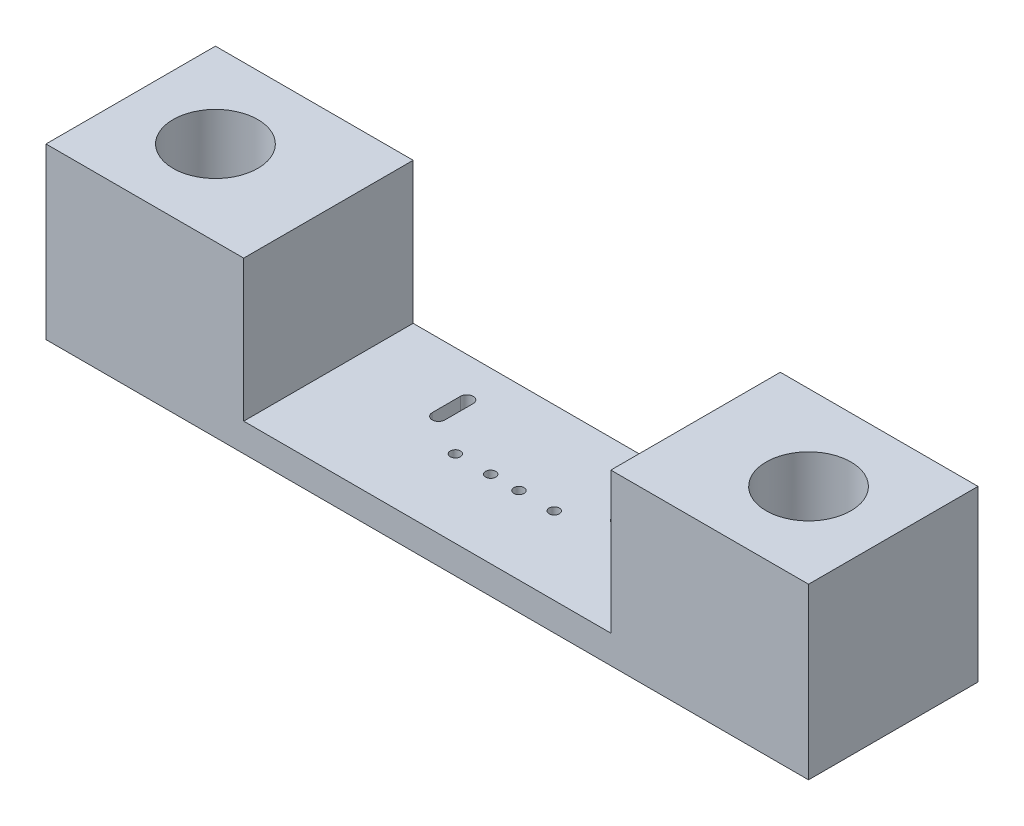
from build123d import *

# Parameters (mm, degrees)
EXTRUDE_1_DEPTH      = 12
SKETCH_2_OUTSIDE_W   = 67.32
SKETCH_2_OUTSIDE_H   = 25.32
SKETCH_2_OUTSIDE_W_2 = 54
SKETCH_2_OUTSIDE_H_2 = 12
SKETCH_2_OUTSIDE_R   = 0.36
SKETCH_2_OUTSIDE_R_2 = 1.75
CUT_EXTRUDE_1_DEPTH  = 57.603886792
SKETCH_3_R           = 3
CUT_EXTRUDE_2_DEPTH  = 6
SKETCH_5_R           = 3.25
CUT_EXTRUDE_3_DEPTH  = 6


with BuildPart() as part:
    # Sketch 1 → Extrude 1 (new body)
    with BuildSketch(Plane.XY):
        Polygon((0, 0), (54, 0), (54, 12), (40, 12), (40, 2), (14, 2), (14, 12), (0, 12), align=None)
    extrude(amount=EXTRUDE_1_DEPTH)

    # Sketch 2 outside → Cut-Extrude 1 (cut, through all)
    # profile 1 of 9: a face of its own
    with BuildSketch(Plane(origin=(0, 12, 0), x_dir=(1, 0, 0), z_dir=(0, 1, 0))):
        with Locations((27, -6)):
            Rectangle(SKETCH_2_OUTSIDE_W, SKETCH_2_OUTSIDE_H)
        with Locations((27, -6)):
            Rectangle(SKETCH_2_OUTSIDE_W_2, SKETCH_2_OUTSIDE_H_2, mode=Mode.SUBTRACT)
    # profile 2 of 9: a face of its own
    with BuildSketch(Plane(origin=(0, 12, 0), x_dir=(1, 0, 0), z_dir=(0, 1, 0))):
        with Locations(Location((30.5, -6.51, 0), (0, 0, 270))):
            Circle(SKETCH_2_OUTSIDE_R)
    # profile 3 of 9: a face of its own
    with BuildSketch(Plane(origin=(0, 12, 0), x_dir=(1, 0, 0), z_dir=(0, 1, 0))):
        with Locations(Location((28, -6.51, 0), (0, 0, 270))):
            Circle(SKETCH_2_OUTSIDE_R)
    # profile 4 of 9: a face of its own
    with BuildSketch(Plane(origin=(0, 12, 0), x_dir=(1, 0, 0), z_dir=(0, 1, 0))):
        with Locations(Location((26, -6.51, 0), (0, 0, 270))):
            Circle(SKETCH_2_OUTSIDE_R)
    # profile 5 of 9: a face of its own
    with BuildSketch(Plane(origin=(0, 12, 0), x_dir=(1, 0, 0), z_dir=(0, 1, 0))):
        with Locations(Location((23.5, -6.51, 0), (0, 0, 270))):
            Circle(SKETCH_2_OUTSIDE_R)
    # profile 6 of 9: a face of its own
    with BuildSketch(Plane(origin=(0, 12, 0), x_dir=(1, 0, 0), z_dir=(0, 1, 0))):
        with Locations(Location((6, -6, 0), (0, 0, 270))):
            Circle(SKETCH_2_OUTSIDE_R_2)
    # profile 7 of 9: a face of its own
    with BuildSketch(Plane(origin=(0, 12, 0), x_dir=(1, 0, 0), z_dir=(0, 1, 0))):
        with Locations(Location((48, -6, 0), (0, 0, 270))):
            Circle(SKETCH_2_OUTSIDE_R_2)
    # profile 8 of 9: a face of its own
    with BuildSketch(Plane(origin=(0, 12, 0), x_dir=(1, 0, 0), z_dir=(0, 1, 0))):
        with BuildLine():
            Line((33.85, -4.8), (33.85, -2.8))
            ThreePointArc((33.85, -2.8), (33.4, -2.35), (32.95, -2.8))
            Line((32.95, -2.8), (32.95, -4.8))
            ThreePointArc((32.95, -4.8), (33.4, -5.25), (33.85, -4.8))
        make_face()
    # profile 9 of 9: a face of its own
    with BuildSketch(Plane(origin=(0, 12, 0), x_dir=(1, 0, 0), z_dir=(0, 1, 0))):
        with BuildLine():
            Line((21.05, -4.8), (21.05, -2.8))
            ThreePointArc((21.05, -2.8), (20.6, -2.35), (20.15, -2.8))
            Line((20.15, -2.8), (20.15, -4.8))
            ThreePointArc((20.15, -4.8), (20.6, -5.25), (21.05, -4.8))
        make_face()
    extrude(amount=-CUT_EXTRUDE_1_DEPTH, mode=Mode.SUBTRACT)

    # Sketch 3 → Cut-Extrude 2 (cut)
    with BuildSketch(Plane(origin=(0, 12, 0), x_dir=(1, 0, 0), z_dir=(0, 1, 0))):
        with Locations(Location((6, -6, 0), (0, 0, 270))):
            Circle(SKETCH_3_R)
        with Locations(Location((48, -6, 0), (0, 0, 270))):
            Circle(SKETCH_3_R)
    extrude(amount=-CUT_EXTRUDE_2_DEPTH, mode=Mode.SUBTRACT)

    # Sketch 5 → Cut-Extrude 3 (cut)
    with BuildSketch(Plane.XZ):
        with Locations(Location((6, 6, 0), (0, 0, 270))):
            Circle(SKETCH_5_R)
        with Locations(Location((48, 6, 0), (0, 0, 270))):
            Circle(SKETCH_5_R)
    extrude(amount=-CUT_EXTRUDE_3_DEPTH, mode=Mode.SUBTRACT)


solid = part.part
